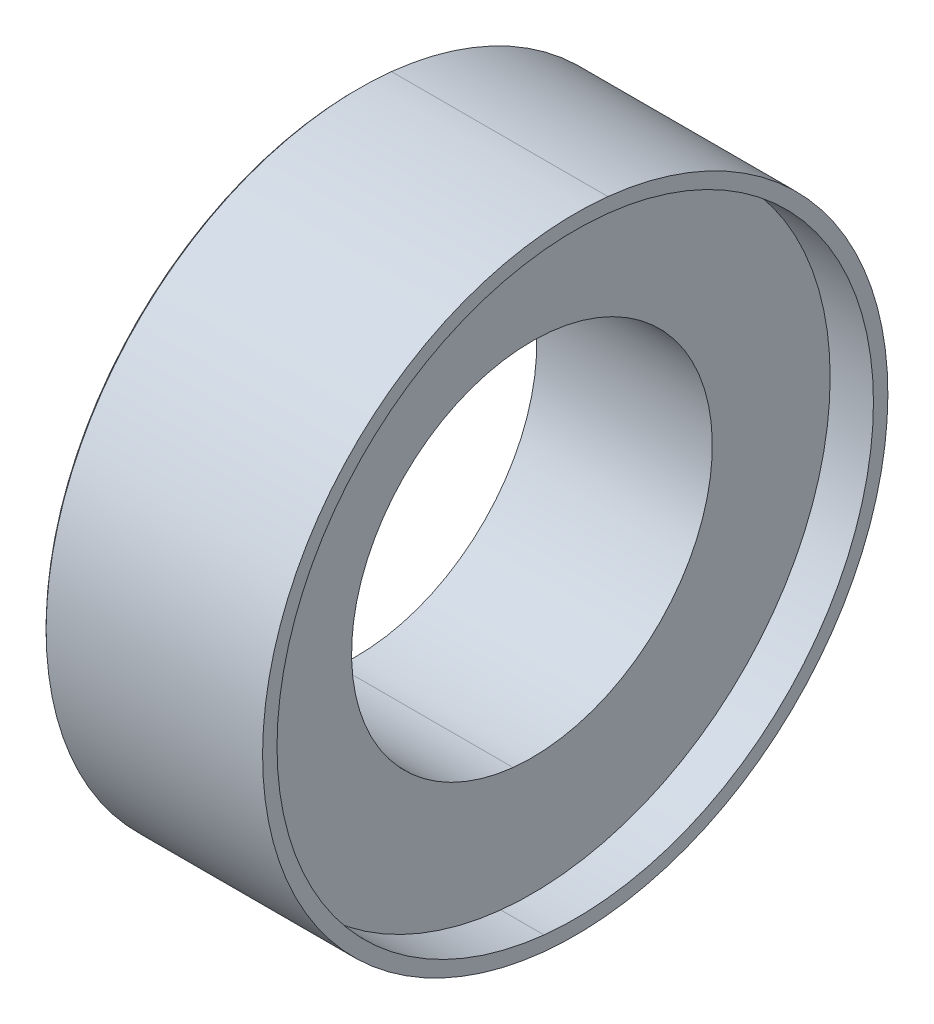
ISO-10303-21;
HEADER;
FILE_DESCRIPTION(('STEP AP214'),'2;1');
FILE_NAME('part.step','',(''),(''),'','','');
FILE_SCHEMA(('AUTOMOTIVE_DESIGN { 1 0 10303 214 1 1 1 1 }'));
ENDSEC;
DATA;
#1=APPLICATION_CONTEXT('core data for automotive mechanical design processes');
#2=APPLICATION_PROTOCOL_DEFINITION('international standard','automotive_design',2000,#1);
#3=PRODUCT_CONTEXT('',#1,'mechanical');
#4=PRODUCT('Part','Part','',(#3));
#5=PRODUCT_RELATED_PRODUCT_CATEGORY('part','',(#4));
#6=PRODUCT_DEFINITION_FORMATION('','',#4);
#7=PRODUCT_DEFINITION_CONTEXT('part definition',#1,'design');
#8=PRODUCT_DEFINITION('design','',#6,#7);
#9=PRODUCT_DEFINITION_SHAPE('','',#8);
#10=(LENGTH_UNIT() NAMED_UNIT(*) SI_UNIT(.MILLI.,.METRE.));
#11=(NAMED_UNIT(*) PLANE_ANGLE_UNIT() SI_UNIT($,.RADIAN.));
#12=(NAMED_UNIT(*) SI_UNIT($,.STERADIAN.) SOLID_ANGLE_UNIT());
#13=UNCERTAINTY_MEASURE_WITH_UNIT(LENGTH_MEASURE(1.E-05),#10,'distance_accuracy_value','');
#14=(GEOMETRIC_REPRESENTATION_CONTEXT(3) GLOBAL_UNCERTAINTY_ASSIGNED_CONTEXT((#13)) GLOBAL_UNIT_ASSIGNED_CONTEXT((#10,
#11,#12)) REPRESENTATION_CONTEXT('',''));
#15=CARTESIAN_POINT('',(0.,0.,0.));
#16=DIRECTION('',(0.,0.,1.));
#17=DIRECTION('',(1.,0.,0.));
#18=AXIS2_PLACEMENT_3D('',#15,#16,#17);
#19=CARTESIAN_POINT('',(23.6,0.,0.));
#20=DIRECTION('',(-1.,0.,0.));
#21=DIRECTION('',(0.,-0.994521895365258,0.104528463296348));
#22=AXIS2_PLACEMENT_3D('',#19,#20,#21);
#23=CYLINDRICAL_SURFACE('',#22,7.5);
#24=DIRECTION('',(-1.,0.,0.));
#25=VECTOR('',#24,1.);
#26=CARTESIAN_POINT('',(23.6,-7.45891421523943,0.783963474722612));
#27=LINE('',#26,#25);
#28=CARTESIAN_POINT('',(27.25,-7.45891421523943,0.783963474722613));
#29=VERTEX_POINT('',#28);
#30=CARTESIAN_POINT('',(19.95,-7.45891421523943,0.783963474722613));
#31=VERTEX_POINT('',#30);
#32=EDGE_CURVE('E114',#29,#31,#27,.T.);
#33=ORIENTED_EDGE('',*,*,#32,.F.);
#34=CARTESIAN_POINT('',(27.25,0.,0.));
#35=DIRECTION('',(-1.,0.,0.));
#36=DIRECTION('',(0.,-0.994521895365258,0.104528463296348));
#37=AXIS2_PLACEMENT_3D('',#34,#35,#36);
#38=CIRCLE('',#37,7.5);
#39=CARTESIAN_POINT('',(27.25,7.45891421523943,-0.783963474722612));
#40=VERTEX_POINT('',#39);
#41=EDGE_CURVE('E37',#40,#29,#38,.T.);
#42=ORIENTED_EDGE('',*,*,#41,.F.);
#43=DIRECTION('',(1.,0.,0.));
#44=VECTOR('',#43,1.);
#45=CARTESIAN_POINT('',(23.6,7.45891421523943,-0.783963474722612));
#46=LINE('',#45,#44);
#47=CARTESIAN_POINT('',(19.95,7.45891421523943,-0.783963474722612));
#48=VERTEX_POINT('',#47);
#49=EDGE_CURVE('E131',#48,#40,#46,.T.);
#50=ORIENTED_EDGE('',*,*,#49,.F.);
#51=CARTESIAN_POINT('',(19.95,0.,0.));
#52=DIRECTION('',(-1.,0.,0.));
#53=DIRECTION('',(0.,-0.994521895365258,0.104528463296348));
#54=AXIS2_PLACEMENT_3D('',#51,#52,#53);
#55=CIRCLE('',#54,7.5);
#56=EDGE_CURVE('E11',#48,#31,#55,.T.);
#57=ORIENTED_EDGE('',*,*,#56,.T.);
#58=EDGE_LOOP('',(#33,#42,#50,#57));
#59=FACE_BOUND('',#58,.T.);
#60=ADVANCED_FACE('F16',(#59),#23,.F.);
#61=CARTESIAN_POINT('',(23.6,0.,0.));
#62=DIRECTION('',(-1.,0.,0.));
#63=DIRECTION('',(0.,-0.994521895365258,0.104528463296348));
#64=AXIS2_PLACEMENT_3D('',#61,#62,#63);
#65=CYLINDRICAL_SURFACE('',#64,13.);
#66=DIRECTION('',(-1.,0.,0.));
#67=VECTOR('',#66,1.);
#68=CARTESIAN_POINT('',(23.6,-12.9287846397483,1.35887002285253));
#69=LINE('',#68,#67);
#70=CARTESIAN_POINT('',(29.05,-12.9287846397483,1.35887002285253));
#71=VERTEX_POINT('',#70);
#72=CARTESIAN_POINT('',(20.05,-12.9287846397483,1.35887002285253));
#73=VERTEX_POINT('',#72);
#74=EDGE_CURVE('E110',#71,#73,#69,.T.);
#75=ORIENTED_EDGE('',*,*,#74,.F.);
#76=CARTESIAN_POINT('',(29.05,0.,0.));
#77=DIRECTION('',(1.,0.,0.));
#78=DIRECTION('',(0.,-0.994521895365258,0.104528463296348));
#79=AXIS2_PLACEMENT_3D('',#76,#77,#78);
#80=CIRCLE('',#79,13.);
#81=CARTESIAN_POINT('',(29.05,12.9287846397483,-1.35887002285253));
#82=VERTEX_POINT('',#81);
#83=EDGE_CURVE('E136',#82,#71,#80,.T.);
#84=ORIENTED_EDGE('',*,*,#83,.F.);
#85=DIRECTION('',(1.,0.,0.));
#86=VECTOR('',#85,1.);
#87=CARTESIAN_POINT('',(23.6,12.9287846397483,-1.35887002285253));
#88=LINE('',#87,#86);
#89=CARTESIAN_POINT('',(20.05,12.9287846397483,-1.35887002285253));
#90=VERTEX_POINT('',#89);
#91=EDGE_CURVE('E98',#90,#82,#88,.T.);
#92=ORIENTED_EDGE('',*,*,#91,.F.);
#93=CARTESIAN_POINT('',(20.05,0.,0.));
#94=DIRECTION('',(1.,0.,0.));
#95=DIRECTION('',(0.,-0.994521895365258,0.104528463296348));
#96=AXIS2_PLACEMENT_3D('',#93,#94,#95);
#97=CIRCLE('',#96,13.);
#98=EDGE_CURVE('E26',#90,#73,#97,.T.);
#99=ORIENTED_EDGE('',*,*,#98,.T.);
#100=EDGE_LOOP('',(#75,#84,#92,#99));
#101=FACE_BOUND('',#100,.T.);
#102=ADVANCED_FACE('F189',(#101),#65,.T.);
#103=CARTESIAN_POINT('',(20.,0.,0.));
#104=DIRECTION('',(1.,0.,0.));
#105=DIRECTION('',(0.,-0.994521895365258,0.104528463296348));
#106=AXIS2_PLACEMENT_3D('',#103,#104,#105);
#107=CONICAL_SURFACE('',#106,12.95,0.785398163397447);
#108=DIRECTION('',(-0.707106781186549,0.70323317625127,-0.0739127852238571));
#109=VECTOR('',#108,1.);
#110=CARTESIAN_POINT('',(20.,-12.8790585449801,1.35364359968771));
#111=LINE('',#110,#109);
#112=CARTESIAN_POINT('',(19.95,-12.8293324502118,1.34841717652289));
#113=VERTEX_POINT('',#112);
#114=EDGE_CURVE('E109',#73,#113,#111,.T.);
#115=ORIENTED_EDGE('',*,*,#114,.F.);
#116=ORIENTED_EDGE('',*,*,#98,.F.);
#117=DIRECTION('',(0.707106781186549,0.70323317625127,-0.0739127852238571));
#118=VECTOR('',#117,1.);
#119=CARTESIAN_POINT('',(20.,12.8790585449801,-1.35364359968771));
#120=LINE('',#119,#118);
#121=CARTESIAN_POINT('',(19.95,12.8293324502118,-1.3484171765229));
#122=VERTEX_POINT('',#121);
#123=EDGE_CURVE('E102',#122,#90,#120,.T.);
#124=ORIENTED_EDGE('',*,*,#123,.F.);
#125=CARTESIAN_POINT('',(19.95,0.,0.));
#126=DIRECTION('',(-1.,0.,0.));
#127=DIRECTION('',(0.,-0.994521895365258,0.104528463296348));
#128=AXIS2_PLACEMENT_3D('',#125,#126,#127);
#129=CIRCLE('',#128,12.9);
#130=EDGE_CURVE('E88',#113,#122,#129,.T.);
#131=ORIENTED_EDGE('',*,*,#130,.F.);
#132=EDGE_LOOP('',(#115,#116,#124,#131));
#133=FACE_BOUND('',#132,.T.);
#134=ADVANCED_FACE('F103',(#133),#107,.T.);
#135=CARTESIAN_POINT('',(28.15,0.,0.));
#136=DIRECTION('',(1.,0.,0.));
#137=DIRECTION('',(0.,-0.994521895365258,0.104528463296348));
#138=AXIS2_PLACEMENT_3D('',#135,#136,#137);
#139=CYLINDRICAL_SURFACE('',#138,12.4);
#140=DIRECTION('',(1.,0.,0.));
#141=VECTOR('',#140,1.);
#142=CARTESIAN_POINT('',(28.15,-12.3320715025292,1.29615294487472));
#143=LINE('',#142,#141);
#144=CARTESIAN_POINT('',(27.25,-12.3320715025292,1.29615294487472));
#145=VERTEX_POINT('',#144);
#146=CARTESIAN_POINT('',(29.05,-12.3320715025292,1.29615294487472));
#147=VERTEX_POINT('',#146);
#148=EDGE_CURVE('E140',#145,#147,#143,.T.);
#149=ORIENTED_EDGE('',*,*,#148,.F.);
#150=CARTESIAN_POINT('',(27.25,0.,0.));
#151=DIRECTION('',(1.,0.,0.));
#152=DIRECTION('',(0.,-0.994521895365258,0.104528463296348));
#153=AXIS2_PLACEMENT_3D('',#150,#151,#152);
#154=CIRCLE('',#153,12.4);
#155=CARTESIAN_POINT('',(27.25,12.3320715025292,-1.29615294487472));
#156=VERTEX_POINT('',#155);
#157=EDGE_CURVE('E148',#156,#145,#154,.T.);
#158=ORIENTED_EDGE('',*,*,#157,.F.);
#159=DIRECTION('',(-1.,0.,0.));
#160=VECTOR('',#159,1.);
#161=CARTESIAN_POINT('',(28.15,12.3320715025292,-1.29615294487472));
#162=LINE('',#161,#160);
#163=CARTESIAN_POINT('',(29.05,12.3320715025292,-1.29615294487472));
#164=VERTEX_POINT('',#163);
#165=EDGE_CURVE('E169',#164,#156,#162,.T.);
#166=ORIENTED_EDGE('',*,*,#165,.F.);
#167=CARTESIAN_POINT('',(29.05,0.,0.));
#168=DIRECTION('',(1.,0.,0.));
#169=DIRECTION('',(0.,-0.994521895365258,0.104528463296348));
#170=AXIS2_PLACEMENT_3D('',#167,#168,#169);
#171=CIRCLE('',#170,12.4);
#172=EDGE_CURVE('E126',#164,#147,#171,.T.);
#173=ORIENTED_EDGE('',*,*,#172,.T.);
#174=EDGE_LOOP('',(#149,#158,#166,#173));
#175=FACE_BOUND('',#174,.T.);
#176=ADVANCED_FACE('F198',(#175),#139,.F.);
#177=CARTESIAN_POINT('',(29.05,-12.6304280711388,1.32751148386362));
#178=DIRECTION('',(1.,0.,0.));
#179=DIRECTION('',(0.,1.,0.));
#180=AXIS2_PLACEMENT_3D('',#177,#178,#179);
#181=PLANE('',#180);
#182=CARTESIAN_POINT('',(29.05,0.,0.));
#183=DIRECTION('',(1.,0.,0.));
#184=DIRECTION('',(0.,-0.994521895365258,0.104528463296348));
#185=AXIS2_PLACEMENT_3D('',#182,#183,#184);
#186=CIRCLE('',#185,13.);
#187=EDGE_CURVE('E130',#71,#82,#186,.T.);
#188=ORIENTED_EDGE('',*,*,#187,.T.);
#189=ORIENTED_EDGE('',*,*,#83,.T.);
#190=EDGE_LOOP('',(#188,#189));
#191=FACE_BOUND('',#190,.T.);
#192=CARTESIAN_POINT('',(29.05,0.,0.));
#193=DIRECTION('',(1.,0.,0.));
#194=DIRECTION('',(0.,-0.994521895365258,0.104528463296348));
#195=AXIS2_PLACEMENT_3D('',#192,#193,#194);
#196=CIRCLE('',#195,12.4);
#197=EDGE_CURVE('E124',#147,#164,#196,.T.);
#198=ORIENTED_EDGE('',*,*,#197,.F.);
#199=ORIENTED_EDGE('',*,*,#172,.F.);
#200=EDGE_LOOP('',(#198,#199));
#201=FACE_BOUND('',#200,.T.);
#202=ADVANCED_FACE('F18',(#191,#201),#181,.T.);
#203=CARTESIAN_POINT('',(28.15,0.,0.));
#204=DIRECTION('',(1.,0.,0.));
#205=DIRECTION('',(0.,-0.994521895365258,0.104528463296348));
#206=AXIS2_PLACEMENT_3D('',#203,#204,#205);
#207=CYLINDRICAL_SURFACE('',#206,12.4);
#208=ORIENTED_EDGE('',*,*,#148,.T.);
#209=ORIENTED_EDGE('',*,*,#197,.T.);
#210=ORIENTED_EDGE('',*,*,#165,.T.);
#211=CARTESIAN_POINT('',(27.25,0.,0.));
#212=DIRECTION('',(1.,0.,0.));
#213=DIRECTION('',(0.,-0.994521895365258,0.104528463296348));
#214=AXIS2_PLACEMENT_3D('',#211,#212,#213);
#215=CIRCLE('',#214,12.4);
#216=EDGE_CURVE('E135',#145,#156,#215,.T.);
#217=ORIENTED_EDGE('',*,*,#216,.F.);
#218=EDGE_LOOP('',(#208,#209,#210,#217));
#219=FACE_BOUND('',#218,.T.);
#220=ADVANCED_FACE('F212',(#219),#207,.F.);
#221=CARTESIAN_POINT('',(20.,0.,0.));
#222=DIRECTION('',(1.,0.,0.));
#223=DIRECTION('',(0.,-0.994521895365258,0.104528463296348));
#224=AXIS2_PLACEMENT_3D('',#221,#222,#223);
#225=CONICAL_SURFACE('',#224,12.95,0.785398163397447);
#226=ORIENTED_EDGE('',*,*,#114,.T.);
#227=CARTESIAN_POINT('',(19.95,0.,0.));
#228=DIRECTION('',(-1.,0.,0.));
#229=DIRECTION('',(0.,-0.994521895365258,0.104528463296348));
#230=AXIS2_PLACEMENT_3D('',#227,#228,#229);
#231=CIRCLE('',#230,12.9);
#232=EDGE_CURVE('E93',#122,#113,#231,.T.);
#233=ORIENTED_EDGE('',*,*,#232,.F.);
#234=ORIENTED_EDGE('',*,*,#123,.T.);
#235=CARTESIAN_POINT('',(20.05,0.,0.));
#236=DIRECTION('',(1.,0.,0.));
#237=DIRECTION('',(0.,-0.994521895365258,0.104528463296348));
#238=AXIS2_PLACEMENT_3D('',#235,#236,#237);
#239=CIRCLE('',#238,13.);
#240=EDGE_CURVE('E152',#73,#90,#239,.T.);
#241=ORIENTED_EDGE('',*,*,#240,.F.);
#242=EDGE_LOOP('',(#226,#233,#234,#241));
#243=FACE_BOUND('',#242,.T.);
#244=ADVANCED_FACE('F112',(#243),#225,.T.);
#245=CARTESIAN_POINT('',(23.6,0.,0.));
#246=DIRECTION('',(-1.,0.,0.));
#247=DIRECTION('',(0.,-0.994521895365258,0.104528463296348));
#248=AXIS2_PLACEMENT_3D('',#245,#246,#247);
#249=CYLINDRICAL_SURFACE('',#248,13.);
#250=ORIENTED_EDGE('',*,*,#74,.T.);
#251=ORIENTED_EDGE('',*,*,#240,.T.);
#252=ORIENTED_EDGE('',*,*,#91,.T.);
#253=ORIENTED_EDGE('',*,*,#187,.F.);
#254=EDGE_LOOP('',(#250,#251,#252,#253));
#255=FACE_BOUND('',#254,.T.);
#256=ADVANCED_FACE('F184',(#255),#249,.T.);
#257=CARTESIAN_POINT('',(19.95,-10.1938494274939,1.07141674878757));
#258=DIRECTION('',(-1.,0.,0.));
#259=DIRECTION('',(0.,0.,1.));
#260=AXIS2_PLACEMENT_3D('',#257,#258,#259);
#261=PLANE('',#260);
#262=ORIENTED_EDGE('',*,*,#130,.T.);
#263=ORIENTED_EDGE('',*,*,#232,.T.);
#264=EDGE_LOOP('',(#262,#263));
#265=FACE_BOUND('',#264,.T.);
#266=CARTESIAN_POINT('',(19.95,0.,0.));
#267=DIRECTION('',(-1.,0.,0.));
#268=DIRECTION('',(0.,-0.994521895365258,0.104528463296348));
#269=AXIS2_PLACEMENT_3D('',#266,#267,#268);
#270=CIRCLE('',#269,7.5);
#271=EDGE_CURVE('E120',#31,#48,#270,.T.);
#272=ORIENTED_EDGE('',*,*,#271,.F.);
#273=ORIENTED_EDGE('',*,*,#56,.F.);
#274=EDGE_LOOP('',(#272,#273));
#275=FACE_BOUND('',#274,.T.);
#276=ADVANCED_FACE('F90',(#265,#275),#261,.T.);
#277=CARTESIAN_POINT('',(23.6,0.,0.));
#278=DIRECTION('',(-1.,0.,0.));
#279=DIRECTION('',(0.,-0.994521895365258,0.104528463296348));
#280=AXIS2_PLACEMENT_3D('',#277,#278,#279);
#281=CYLINDRICAL_SURFACE('',#280,7.5);
#282=ORIENTED_EDGE('',*,*,#32,.T.);
#283=ORIENTED_EDGE('',*,*,#271,.T.);
#284=ORIENTED_EDGE('',*,*,#49,.T.);
#285=CARTESIAN_POINT('',(27.25,0.,0.));
#286=DIRECTION('',(-1.,0.,0.));
#287=DIRECTION('',(0.,-0.994521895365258,0.104528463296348));
#288=AXIS2_PLACEMENT_3D('',#285,#286,#287);
#289=CIRCLE('',#288,7.5);
#290=EDGE_CURVE('E156',#29,#40,#289,.T.);
#291=ORIENTED_EDGE('',*,*,#290,.F.);
#292=EDGE_LOOP('',(#282,#283,#284,#291));
#293=FACE_BOUND('',#292,.T.);
#294=ADVANCED_FACE('F210',(#293),#281,.F.);
#295=CARTESIAN_POINT('',(27.25,-10.1938494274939,1.07141674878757));
#296=DIRECTION('',(1.,0.,0.));
#297=DIRECTION('',(0.,1.,0.));
#298=AXIS2_PLACEMENT_3D('',#295,#296,#297);
#299=PLANE('',#298);
#300=ORIENTED_EDGE('',*,*,#216,.T.);
#301=ORIENTED_EDGE('',*,*,#157,.T.);
#302=EDGE_LOOP('',(#300,#301));
#303=FACE_BOUND('',#302,.T.);
#304=ORIENTED_EDGE('',*,*,#290,.T.);
#305=ORIENTED_EDGE('',*,*,#41,.T.);
#306=EDGE_LOOP('',(#304,#305));
#307=FACE_BOUND('',#306,.T.);
#308=ADVANCED_FACE('F203',(#303,#307),#299,.T.);
#309=CLOSED_SHELL('',(#60,#102,#134,#176,#202,#220,#244,#256,#276,#294,#308));
#310=MANIFOLD_SOLID_BREP('B1',#309);
#311=ADVANCED_BREP_SHAPE_REPRESENTATION('',(#18,#310),#14);
#312=SHAPE_DEFINITION_REPRESENTATION(#9,#311);
ENDSEC;
END-ISO-10303-21;
